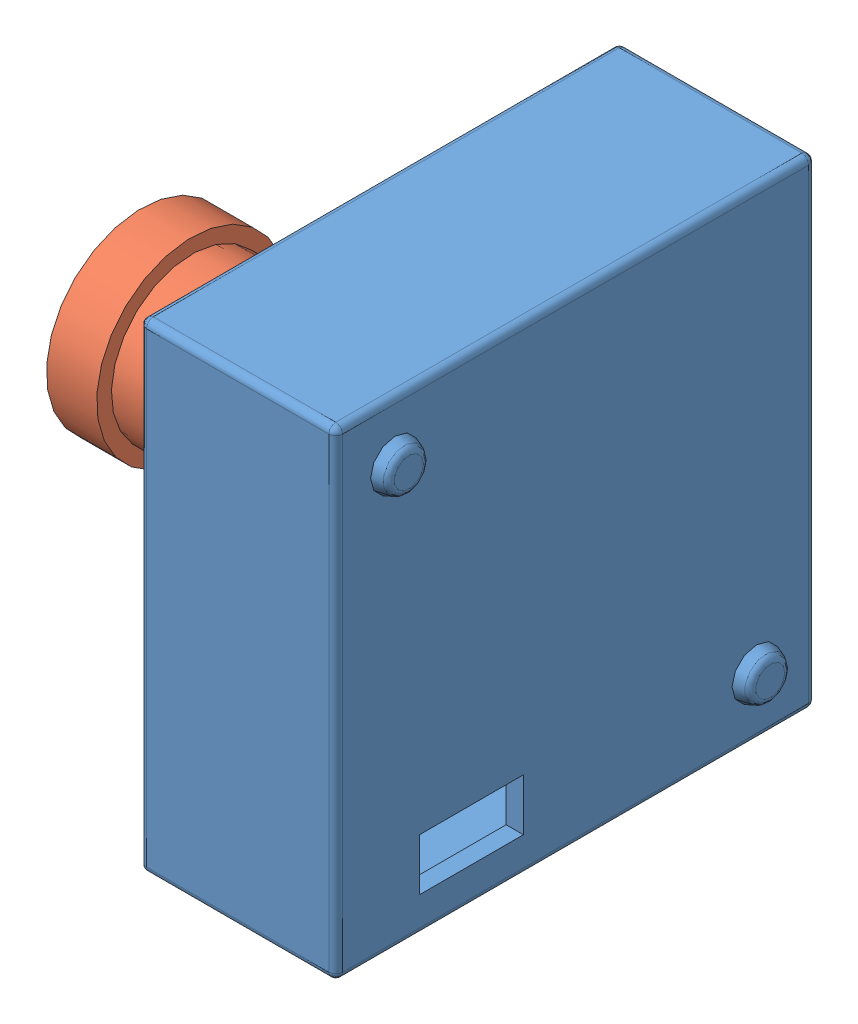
SolidWorks assembly Assem2.sldasm, configuration Default (file format 3100). Lengths in mm.
Overall size (32.86 35.2 35.2).
2 component instances, 2 part files, 1 mates.
Components (placement in the parent):
- CCD camera base-1: CCD camera base.SLDPRT [Default] at (-14.6184 9.1117 0) size (21.64 35.2 35.2)
- CCD camera lens-1: CCD camera lens.SLDPRT [Default] at (-28.5037 9.1117 0) x (1 0 0) z (0 0.535089 0.844796) size (20.19 13.97 13.97)
Mates (geometry in assembly coordinates):
- Concentric1: concentric anti-aligned: circle of CCD camera base-1 centre (-20.9684 9.1117 0) axis (-1 0 0); circle of CCD camera lens-1 centre (-11.9937 9.1117 0) axis (1 0 0)
